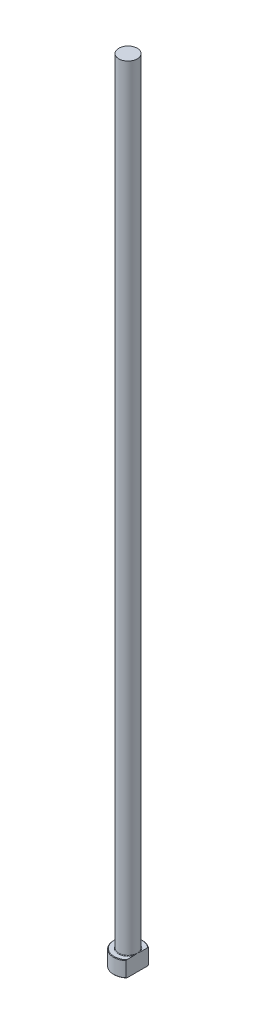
from build123d import *
from build123d.topology import SkipClean

# Parameters (mm, degrees)
CHAMFER1_SIZE    = 0.2
FILLET1_R        = 0.2
KEYED_HEAD_DEPTH = 301.100816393


with BuildPart() as part:
    # Sketch1 → Revolve1 (revolve)
    with BuildSketch(Plane.XY, mode=Mode.PRIVATE) as revolve1_sk:
        Polygon((0, 0), (-5.5, 0), (-5.5, 6), (-3.5, 6), (-3.5, 300), (0, 300), align=None)
    revolve(revolve1_sk.sketch.rotate(Axis((0, 259.958771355, 0), (0, -1, 0)), 270), axis=Axis((0, 259.958771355, 0), (0, -1, 0)))

    # Chamfer1
    chamfer1_edges = [part.edges().sort_by_distance(p)[0] for p in [
        (0, 6, -5.5),
        (0, 0, -5.5),
    ]]
    chamfer(chamfer1_edges, length=CHAMFER1_SIZE)

    # Fillet1
    fillet1_edges = [part.edges().sort_by_distance(p)[0] for p in [
        (0, 6, -3.5),
    ]]
    fillet(fillet1_edges, radius=FILLET1_R)

    # Sketch2 → KEYED HEAD (cut, through all)
    with SkipClean():  # the faces are left unmerged after this step: merging them gives an invalid solid
        with BuildSketch(Plane(origin=(0, 0, 0), x_dir=(1, 0, 0), z_dir=(0, 1, 0))):
            with BuildLine():
                Line((3.5, -4.242640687), (3.5, 4.242640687))
                ThreePointArc((3.5, 4.242640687), (5.5, 0), (3.5, -4.242640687))
            make_face()
        extrude(amount=KEYED_HEAD_DEPTH, mode=Mode.SUBTRACT)


solid = part.part
